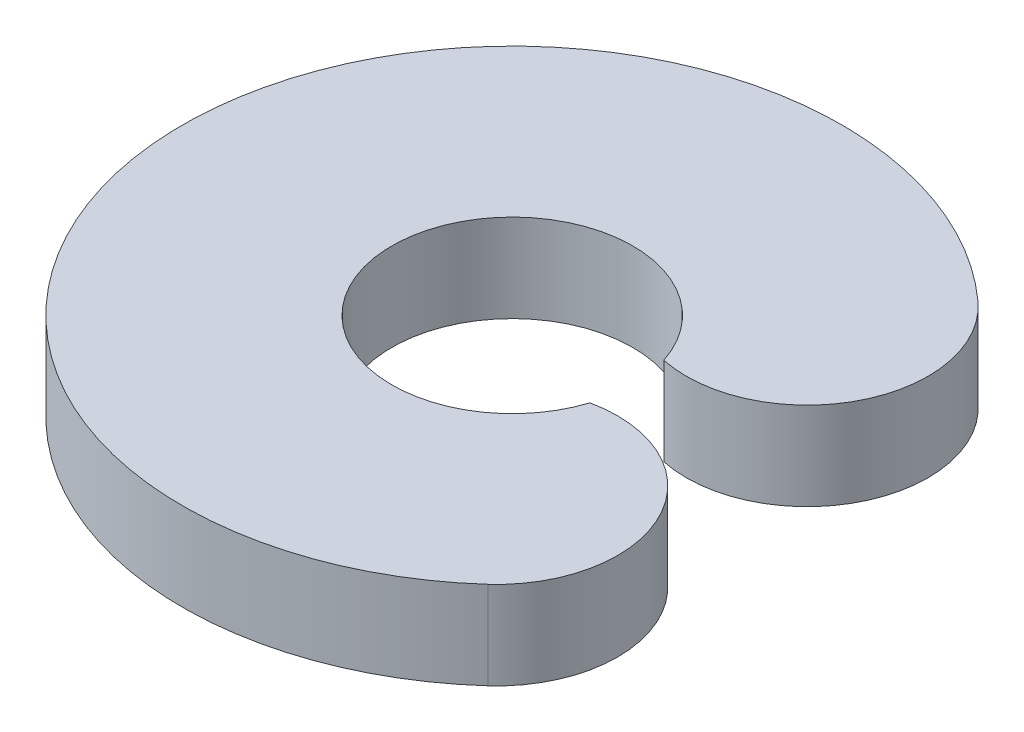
ISO-10303-21;
HEADER;
FILE_DESCRIPTION(('STEP AP214'),'2;1');
FILE_NAME('part.step','',(''),(''),'','','');
FILE_SCHEMA(('AUTOMOTIVE_DESIGN { 1 0 10303 214 1 1 1 1 }'));
ENDSEC;
DATA;
#1=APPLICATION_CONTEXT('core data for automotive mechanical design processes');
#2=APPLICATION_PROTOCOL_DEFINITION('international standard','automotive_design',2000,#1);
#3=PRODUCT_CONTEXT('',#1,'mechanical');
#4=PRODUCT('Part','Part','',(#3));
#5=PRODUCT_RELATED_PRODUCT_CATEGORY('part','',(#4));
#6=PRODUCT_DEFINITION_FORMATION('','',#4);
#7=PRODUCT_DEFINITION_CONTEXT('part definition',#1,'design');
#8=PRODUCT_DEFINITION('design','',#6,#7);
#9=PRODUCT_DEFINITION_SHAPE('','',#8);
#10=(LENGTH_UNIT() NAMED_UNIT(*) SI_UNIT(.MILLI.,.METRE.));
#11=(NAMED_UNIT(*) PLANE_ANGLE_UNIT() SI_UNIT($,.RADIAN.));
#12=(NAMED_UNIT(*) SI_UNIT($,.STERADIAN.) SOLID_ANGLE_UNIT());
#13=UNCERTAINTY_MEASURE_WITH_UNIT(LENGTH_MEASURE(1.E-05),#10,'distance_accuracy_value','');
#14=(GEOMETRIC_REPRESENTATION_CONTEXT(3) GLOBAL_UNCERTAINTY_ASSIGNED_CONTEXT((#13)) GLOBAL_UNIT_ASSIGNED_CONTEXT((#10,
#11,#12)) REPRESENTATION_CONTEXT('',''));
#15=CARTESIAN_POINT('',(0.,0.,0.));
#16=DIRECTION('',(0.,0.,1.));
#17=DIRECTION('',(1.,0.,0.));
#18=AXIS2_PLACEMENT_3D('',#15,#16,#17);
#19=CARTESIAN_POINT('',(317.83703802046,-465.,-352.993792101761));
#20=DIRECTION('',(0.,1.,0.));
#21=DIRECTION('',(0.,0.,1.));
#22=AXIS2_PLACEMENT_3D('',#19,#20,#21);
#23=CYLINDRICAL_SURFACE('',#22,275.);
#24=CARTESIAN_POINT('',(317.83703802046,-265.,-352.993792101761));
#25=DIRECTION('',(0.,1.,0.));
#26=DIRECTION('',(0.,0.,1.));
#27=AXIS2_PLACEMENT_3D('',#24,#25,#26);
#28=CIRCLE('',#27,275.);
#29=CARTESIAN_POINT('',(260.661323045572,-265.,-84.0032018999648));
#30=VERTEX_POINT('',#29);
#31=CARTESIAN_POINT('',(501.847954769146,-265.,-557.358619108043));
#32=VERTEX_POINT('',#31);
#33=EDGE_CURVE('E80',#30,#32,#28,.T.);
#34=ORIENTED_EDGE('',*,*,#33,.F.);
#35=DIRECTION('',(0.,1.,0.));
#36=VECTOR('',#35,1.);
#37=CARTESIAN_POINT('',(260.661323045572,-465.,-84.0032018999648));
#38=LINE('',#37,#36);
#39=CARTESIAN_POINT('',(260.661323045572,-465.,-84.0032018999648));
#40=VERTEX_POINT('',#39);
#41=EDGE_CURVE('E10',#40,#30,#38,.T.);
#42=ORIENTED_EDGE('',*,*,#41,.F.);
#43=CARTESIAN_POINT('',(317.83703802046,-465.,-352.993792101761));
#44=DIRECTION('',(0.,1.,0.));
#45=DIRECTION('',(0.,0.,1.));
#46=AXIS2_PLACEMENT_3D('',#43,#44,#45);
#47=CIRCLE('',#46,275.);
#48=CARTESIAN_POINT('',(501.847954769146,-465.,-557.358619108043));
#49=VERTEX_POINT('',#48);
#50=EDGE_CURVE('E74',#40,#49,#47,.T.);
#51=ORIENTED_EDGE('',*,*,#50,.T.);
#52=DIRECTION('',(0.,1.,0.));
#53=VECTOR('',#52,1.);
#54=CARTESIAN_POINT('',(501.847954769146,-465.,-557.358619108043));
#55=LINE('',#54,#53);
#56=EDGE_CURVE('E19',#49,#32,#55,.T.);
#57=ORIENTED_EDGE('',*,*,#56,.T.);
#58=EDGE_LOOP('',(#34,#42,#51,#57));
#59=FACE_BOUND('',#58,.T.);
#60=ADVANCED_FACE('F16',(#59),#23,.T.);
#61=CARTESIAN_POINT('',(0.,-465.,0.));
#62=DIRECTION('',(0.,1.,0.));
#63=DIRECTION('',(0.,0.,1.));
#64=AXIS2_PLACEMENT_3D('',#61,#62,#63);
#65=CYLINDRICAL_SURFACE('',#64,273.862854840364);
#66=CARTESIAN_POINT('',(0.,-265.,0.));
#67=DIRECTION('',(0.,-1.,0.));
#68=DIRECTION('',(0.,0.,1.));
#69=AXIS2_PLACEMENT_3D('',#66,#67,#68);
#70=CIRCLE('',#69,273.862854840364);
#71=CARTESIAN_POINT('',(260.661323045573,-265.,84.0032018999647));
#72=VERTEX_POINT('',#71);
#73=EDGE_CURVE('E76',#72,#30,#70,.T.);
#74=ORIENTED_EDGE('',*,*,#73,.F.);
#75=DIRECTION('',(0.,1.,0.));
#76=VECTOR('',#75,1.);
#77=CARTESIAN_POINT('',(260.661323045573,-465.,84.0032018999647));
#78=LINE('',#77,#76);
#79=CARTESIAN_POINT('',(260.661323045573,-465.,84.0032018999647));
#80=VERTEX_POINT('',#79);
#81=EDGE_CURVE('E25',#80,#72,#78,.T.);
#82=ORIENTED_EDGE('',*,*,#81,.F.);
#83=CARTESIAN_POINT('',(0.,-465.,0.));
#84=DIRECTION('',(0.,-1.,0.));
#85=DIRECTION('',(0.,0.,1.));
#86=AXIS2_PLACEMENT_3D('',#83,#84,#85);
#87=CIRCLE('',#86,273.862854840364);
#88=EDGE_CURVE('E71',#80,#40,#87,.T.);
#89=ORIENTED_EDGE('',*,*,#88,.T.);
#90=ORIENTED_EDGE('',*,*,#41,.T.);
#91=EDGE_LOOP('',(#74,#82,#89,#90));
#92=FACE_BOUND('',#91,.T.);
#93=ADVANCED_FACE('F90',(#92),#65,.F.);
#94=CARTESIAN_POINT('',(317.83703802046,-465.,352.99379210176));
#95=DIRECTION('',(0.,1.,0.));
#96=DIRECTION('',(0.,0.,1.));
#97=AXIS2_PLACEMENT_3D('',#94,#95,#96);
#98=CYLINDRICAL_SURFACE('',#97,275.);
#99=CARTESIAN_POINT('',(317.83703802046,-265.,352.99379210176));
#100=DIRECTION('',(0.,1.,0.));
#101=DIRECTION('',(0.,0.,1.));
#102=AXIS2_PLACEMENT_3D('',#99,#100,#101);
#103=CIRCLE('',#102,275.);
#104=CARTESIAN_POINT('',(501.847954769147,-265.,557.358619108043));
#105=VERTEX_POINT('',#104);
#106=EDGE_CURVE('E66',#105,#72,#103,.T.);
#107=ORIENTED_EDGE('',*,*,#106,.F.);
#108=DIRECTION('',(0.,1.,0.));
#109=VECTOR('',#108,1.);
#110=CARTESIAN_POINT('',(501.847954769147,-465.,557.358619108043));
#111=LINE('',#110,#109);
#112=CARTESIAN_POINT('',(501.847954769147,-465.,557.358619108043));
#113=VERTEX_POINT('',#112);
#114=EDGE_CURVE('E61',#113,#105,#111,.T.);
#115=ORIENTED_EDGE('',*,*,#114,.F.);
#116=CARTESIAN_POINT('',(317.83703802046,-465.,352.99379210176));
#117=DIRECTION('',(0.,1.,0.));
#118=DIRECTION('',(0.,0.,1.));
#119=AXIS2_PLACEMENT_3D('',#116,#117,#118);
#120=CIRCLE('',#119,275.);
#121=EDGE_CURVE('E64',#113,#80,#120,.T.);
#122=ORIENTED_EDGE('',*,*,#121,.T.);
#123=ORIENTED_EDGE('',*,*,#81,.T.);
#124=EDGE_LOOP('',(#107,#115,#122,#123));
#125=FACE_BOUND('',#124,.T.);
#126=ADVANCED_FACE('F63',(#125),#98,.T.);
#127=CARTESIAN_POINT('',(0.,-465.,0.));
#128=DIRECTION('',(0.,1.,0.));
#129=DIRECTION('',(0.,0.,1.));
#130=AXIS2_PLACEMENT_3D('',#127,#128,#129);
#131=CYLINDRICAL_SURFACE('',#130,750.);
#132=CARTESIAN_POINT('',(0.,-265.,0.));
#133=DIRECTION('',(0.,1.,0.));
#134=DIRECTION('',(0.,0.,1.));
#135=AXIS2_PLACEMENT_3D('',#132,#133,#134);
#136=CIRCLE('',#135,750.);
#137=EDGE_CURVE('E83',#32,#105,#136,.T.);
#138=ORIENTED_EDGE('',*,*,#137,.F.);
#139=ORIENTED_EDGE('',*,*,#56,.F.);
#140=CARTESIAN_POINT('',(0.,-465.,0.));
#141=DIRECTION('',(0.,1.,0.));
#142=DIRECTION('',(0.,0.,1.));
#143=AXIS2_PLACEMENT_3D('',#140,#141,#142);
#144=CIRCLE('',#143,750.);
#145=EDGE_CURVE('E70',#49,#113,#144,.T.);
#146=ORIENTED_EDGE('',*,*,#145,.T.);
#147=ORIENTED_EDGE('',*,*,#114,.T.);
#148=EDGE_LOOP('',(#138,#139,#146,#147));
#149=FACE_BOUND('',#148,.T.);
#150=ADVANCED_FACE('F73',(#149),#131,.T.);
#151=CARTESIAN_POINT('',(158.91851901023,-465.,-176.49689605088));
#152=DIRECTION('',(0.,1.,0.));
#153=DIRECTION('',(0.,0.,1.));
#154=AXIS2_PLACEMENT_3D('',#151,#152,#153);
#155=PLANE('',#154);
#156=ORIENTED_EDGE('',*,*,#50,.F.);
#157=ORIENTED_EDGE('',*,*,#88,.F.);
#158=ORIENTED_EDGE('',*,*,#121,.F.);
#159=ORIENTED_EDGE('',*,*,#145,.F.);
#160=EDGE_LOOP('',(#156,#157,#158,#159));
#161=FACE_BOUND('',#160,.T.);
#162=ADVANCED_FACE('F69',(#161),#155,.F.);
#163=CARTESIAN_POINT('',(158.91851901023,-265.,-176.49689605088));
#164=DIRECTION('',(0.,1.,0.));
#165=DIRECTION('',(0.,0.,1.));
#166=AXIS2_PLACEMENT_3D('',#163,#164,#165);
#167=PLANE('',#166);
#168=ORIENTED_EDGE('',*,*,#33,.T.);
#169=ORIENTED_EDGE('',*,*,#137,.T.);
#170=ORIENTED_EDGE('',*,*,#106,.T.);
#171=ORIENTED_EDGE('',*,*,#73,.T.);
#172=EDGE_LOOP('',(#168,#169,#170,#171));
#173=FACE_BOUND('',#172,.T.);
#174=ADVANCED_FACE('F89',(#173),#167,.T.);
#175=CLOSED_SHELL('',(#60,#93,#126,#150,#162,#174));
#176=MANIFOLD_SOLID_BREP('B1',#175);
#177=ADVANCED_BREP_SHAPE_REPRESENTATION('',(#18,#176),#14);
#178=SHAPE_DEFINITION_REPRESENTATION(#9,#177);
ENDSEC;
END-ISO-10303-21;
